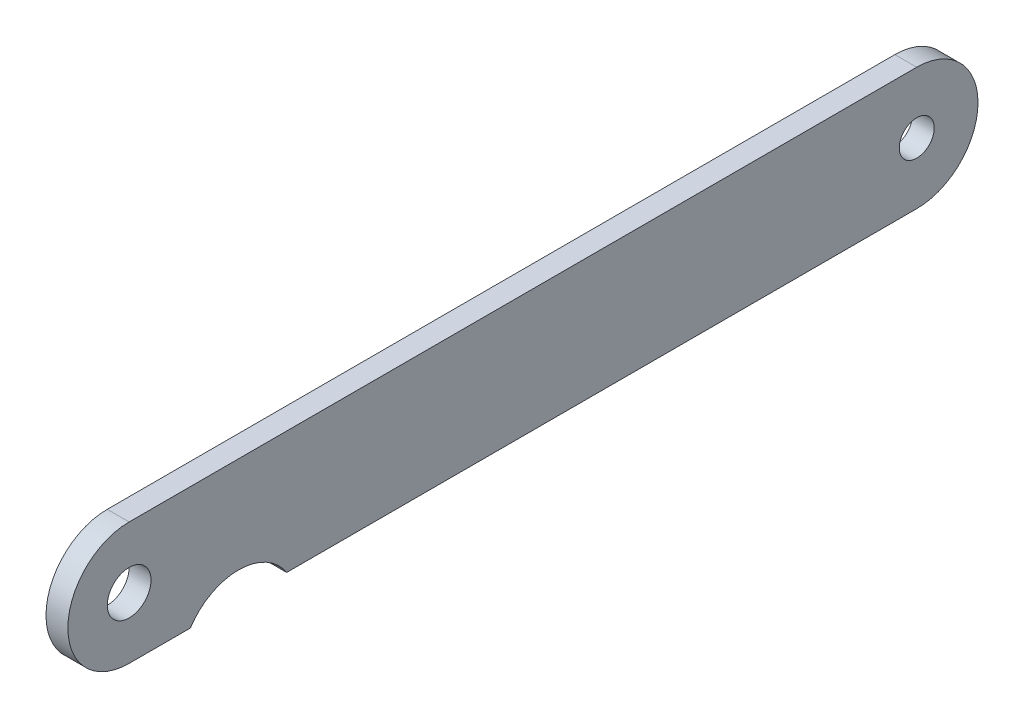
ISO-10303-21;
HEADER;
FILE_DESCRIPTION(('STEP AP214'),'2;1');
FILE_NAME('part.step','',(''),(''),'','','');
FILE_SCHEMA(('AUTOMOTIVE_DESIGN { 1 0 10303 214 1 1 1 1 }'));
ENDSEC;
DATA;
#1=APPLICATION_CONTEXT('core data for automotive mechanical design processes');
#2=APPLICATION_PROTOCOL_DEFINITION('international standard','automotive_design',2000,#1);
#3=PRODUCT_CONTEXT('',#1,'mechanical');
#4=PRODUCT('Part','Part','',(#3));
#5=PRODUCT_RELATED_PRODUCT_CATEGORY('part','',(#4));
#6=PRODUCT_DEFINITION_FORMATION('','',#4);
#7=PRODUCT_DEFINITION_CONTEXT('part definition',#1,'design');
#8=PRODUCT_DEFINITION('design','',#6,#7);
#9=PRODUCT_DEFINITION_SHAPE('','',#8);
#10=(LENGTH_UNIT() NAMED_UNIT(*) SI_UNIT(.MILLI.,.METRE.));
#11=(NAMED_UNIT(*) PLANE_ANGLE_UNIT() SI_UNIT($,.RADIAN.));
#12=(NAMED_UNIT(*) SI_UNIT($,.STERADIAN.) SOLID_ANGLE_UNIT());
#13=UNCERTAINTY_MEASURE_WITH_UNIT(LENGTH_MEASURE(1.E-05),#10,'distance_accuracy_value','');
#14=(GEOMETRIC_REPRESENTATION_CONTEXT(3) GLOBAL_UNCERTAINTY_ASSIGNED_CONTEXT((#13)) GLOBAL_UNIT_ASSIGNED_CONTEXT((#10,
#11,#12)) REPRESENTATION_CONTEXT('',''));
#15=CARTESIAN_POINT('',(0.,0.,0.));
#16=DIRECTION('',(0.,0.,1.));
#17=DIRECTION('',(1.,0.,0.));
#18=AXIS2_PLACEMENT_3D('',#15,#16,#17);
#19=CARTESIAN_POINT('',(2.49999999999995,-6.99999999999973,2.22044604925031E-13));
#20=DIRECTION('',(-0.999999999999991,0.,0.));
#21=DIRECTION('',(0.,0.,0.999999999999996));
#22=AXIS2_PLACEMENT_3D('',#19,#20,#21);
#23=PLANE('',#22);
#24=CARTESIAN_POINT('',(2.50000000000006,-7.00000000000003,-89.9999999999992));
#25=DIRECTION('',(0.999999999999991,0.,0.));
#26=DIRECTION('',(0.,0.,-0.999999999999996));
#27=AXIS2_PLACEMENT_3D('',#24,#25,#26);
#28=CIRCLE('',#27,1.99999999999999);
#29=CARTESIAN_POINT('',(2.50000000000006,-7.00000000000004,-91.9999999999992));
#30=VERTEX_POINT('',#29);
#31=EDGE_CURVE('E146',#30,#30,#28,.T.);
#32=ORIENTED_EDGE('',*,*,#31,.F.);
#33=EDGE_LOOP('',(#32));
#34=FACE_BOUND('',#33,.T.);
#35=DIRECTION('',(0.,0.,-0.999999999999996));
#36=VECTOR('',#35,1.);
#37=CARTESIAN_POINT('',(2.49999999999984,-14.0000000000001,1.33226762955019E-12));
#38=LINE('',#37,#36);
#39=CARTESIAN_POINT('',(2.49999999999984,-14.0000000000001,1.33226762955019E-12));
#40=VERTEX_POINT('',#39);
#41=CARTESIAN_POINT('',(2.49999999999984,-14.0000000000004,-6.99999999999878));
#42=VERTEX_POINT('',#41);
#43=EDGE_CURVE('E100',#40,#42,#38,.T.);
#44=ORIENTED_EDGE('',*,*,#43,.T.);
#45=CARTESIAN_POINT('',(2.49999999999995,-17.5416666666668,-12.4999999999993));
#46=DIRECTION('',(0.999999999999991,0.,0.));
#47=DIRECTION('',(0.,0.,0.999999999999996));
#48=AXIS2_PLACEMENT_3D('',#45,#46,#47);
#49=CIRCLE('',#48,6.54166666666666);
#50=CARTESIAN_POINT('',(2.49999999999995,-14.0000000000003,-17.9999999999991));
#51=VERTEX_POINT('',#50);
#52=EDGE_CURVE('E88',#51,#42,#49,.T.);
#53=ORIENTED_EDGE('',*,*,#52,.F.);
#54=CARTESIAN_POINT('',(2.49999999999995,-14.0000000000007,-89.9999999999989));
#55=VERTEX_POINT('',#54);
#56=EDGE_CURVE('E108',#51,#55,#38,.T.);
#57=ORIENTED_EDGE('',*,*,#56,.T.);
#58=CARTESIAN_POINT('',(2.50000000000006,-7.00000000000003,-89.9999999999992));
#59=DIRECTION('',(0.999999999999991,0.,0.));
#60=DIRECTION('',(0.,0.,-0.999999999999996));
#61=AXIS2_PLACEMENT_3D('',#58,#59,#60);
#62=CIRCLE('',#61,7.);
#63=CARTESIAN_POINT('',(2.5,0.,-89.9999999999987));
#64=VERTEX_POINT('',#63);
#65=EDGE_CURVE('E107',#55,#64,#62,.T.);
#66=ORIENTED_EDGE('',*,*,#65,.T.);
#67=DIRECTION('',(0.,0.,0.999999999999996));
#68=VECTOR('',#67,1.);
#69=CARTESIAN_POINT('',(2.49999999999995,1.11022302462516E-13,4.71844785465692E-13));
#70=LINE('',#69,#68);
#71=CARTESIAN_POINT('',(2.49999999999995,1.11022302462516E-13,4.71844785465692E-13));
#72=VERTEX_POINT('',#71);
#73=EDGE_CURVE('E59',#64,#72,#70,.T.);
#74=ORIENTED_EDGE('',*,*,#73,.T.);
#75=CARTESIAN_POINT('',(2.49999999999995,-6.99999999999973,2.22044604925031E-13));
#76=DIRECTION('',(0.999999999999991,0.,0.));
#77=DIRECTION('',(0.,0.,0.999999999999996));
#78=AXIS2_PLACEMENT_3D('',#75,#76,#77);
#79=CIRCLE('',#78,7.);
#80=EDGE_CURVE('E105',#72,#40,#79,.T.);
#81=ORIENTED_EDGE('',*,*,#80,.T.);
#82=EDGE_LOOP('',(#44,#53,#57,#66,#74,#81));
#83=FACE_BOUND('',#82,.T.);
#84=CARTESIAN_POINT('',(2.49999999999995,-6.99999999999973,2.22044604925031E-13));
#85=DIRECTION('',(0.999999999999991,0.,0.));
#86=DIRECTION('',(0.,0.,-0.999999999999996));
#87=AXIS2_PLACEMENT_3D('',#84,#85,#86);
#88=CIRCLE('',#87,2.49999999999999);
#89=CARTESIAN_POINT('',(2.49999999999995,-6.99999999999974,-2.49999999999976));
#90=VERTEX_POINT('',#89);
#91=EDGE_CURVE('E152',#90,#90,#88,.T.);
#92=ORIENTED_EDGE('',*,*,#91,.F.);
#93=EDGE_LOOP('',(#92));
#94=FACE_BOUND('',#93,.T.);
#95=ADVANCED_FACE('F36',(#34,#83,#94),#23,.F.);
#96=CARTESIAN_POINT('',(2.49999999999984,-14.0000000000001,1.33226762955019E-12));
#97=DIRECTION('',(0.,0.999999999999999,0.));
#98=DIRECTION('',(0.,0.,0.999999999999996));
#99=AXIS2_PLACEMENT_3D('',#96,#97,#98);
#100=PLANE('',#99);
#101=DIRECTION('',(0.,0.,-0.999999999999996));
#102=VECTOR('',#101,1.);
#103=CARTESIAN_POINT('',(-1.11022302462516E-13,-14.0000000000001,1.33226762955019E-12));
#104=LINE('',#103,#102);
#105=CARTESIAN_POINT('',(-1.11022302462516E-13,-14.0000000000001,1.33226762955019E-12));
#106=VERTEX_POINT('',#105);
#107=CARTESIAN_POINT('',(-1.11022302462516E-13,-14.0000000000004,-6.99999999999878));
#108=VERTEX_POINT('',#107);
#109=EDGE_CURVE('E101',#106,#108,#104,.T.);
#110=ORIENTED_EDGE('',*,*,#109,.T.);
#111=DIRECTION('',(0.999999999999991,0.,0.));
#112=VECTOR('',#111,1.);
#113=CARTESIAN_POINT('',(-1.11022302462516E-13,-14.0000000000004,-6.99999999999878));
#114=LINE('',#113,#112);
#115=EDGE_CURVE('E51',#108,#42,#114,.T.);
#116=ORIENTED_EDGE('',*,*,#115,.T.);
#117=ORIENTED_EDGE('',*,*,#43,.F.);
#118=DIRECTION('',(-0.999999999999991,0.,0.));
#119=VECTOR('',#118,1.);
#120=CARTESIAN_POINT('',(2.49999999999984,-14.0000000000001,1.33226762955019E-12));
#121=LINE('',#120,#119);
#122=EDGE_CURVE('E11',#40,#106,#121,.T.);
#123=ORIENTED_EDGE('',*,*,#122,.T.);
#124=EDGE_LOOP('',(#110,#116,#117,#123));
#125=FACE_BOUND('',#124,.T.);
#126=ADVANCED_FACE('F99',(#125),#100,.F.);
#127=CARTESIAN_POINT('',(2.49999999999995,-6.99999999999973,2.22044604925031E-13));
#128=DIRECTION('',(-0.999999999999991,0.,0.));
#129=DIRECTION('',(0.,0.,0.999999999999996));
#130=AXIS2_PLACEMENT_3D('',#127,#128,#129);
#131=CYLINDRICAL_SURFACE('',#130,7.);
#132=CARTESIAN_POINT('',(0.,-6.99999999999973,2.22044604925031E-13));
#133=DIRECTION('',(0.999999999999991,0.,0.));
#134=DIRECTION('',(0.,0.,0.999999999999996));
#135=AXIS2_PLACEMENT_3D('',#132,#133,#134);
#136=CIRCLE('',#135,7.);
#137=CARTESIAN_POINT('',(0.,0.,0.));
#138=VERTEX_POINT('',#137);
#139=EDGE_CURVE('E139',#138,#106,#136,.T.);
#140=ORIENTED_EDGE('',*,*,#139,.T.);
#141=ORIENTED_EDGE('',*,*,#122,.F.);
#142=ORIENTED_EDGE('',*,*,#80,.F.);
#143=DIRECTION('',(-0.999999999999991,0.,0.));
#144=VECTOR('',#143,1.);
#145=CARTESIAN_POINT('',(2.49999999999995,1.11022302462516E-13,4.71844785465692E-13));
#146=LINE('',#145,#144);
#147=EDGE_CURVE('E115',#72,#138,#146,.T.);
#148=ORIENTED_EDGE('',*,*,#147,.T.);
#149=EDGE_LOOP('',(#140,#141,#142,#148));
#150=FACE_BOUND('',#149,.T.);
#151=ADVANCED_FACE('F38',(#150),#131,.T.);
#152=ORIENTED_EDGE('',*,*,#56,.F.);
#153=DIRECTION('',(0.999999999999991,0.,0.));
#154=VECTOR('',#153,1.);
#155=CARTESIAN_POINT('',(0.,-14.0000000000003,-17.9999999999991));
#156=LINE('',#155,#154);
#157=CARTESIAN_POINT('',(0.,-14.0000000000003,-17.9999999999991));
#158=VERTEX_POINT('',#157);
#159=EDGE_CURVE('E91',#158,#51,#156,.T.);
#160=ORIENTED_EDGE('',*,*,#159,.F.);
#161=CARTESIAN_POINT('',(-1.11022302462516E-13,-14.0000000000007,-89.9999999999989));
#162=VERTEX_POINT('',#161);
#163=EDGE_CURVE('E133',#158,#162,#104,.T.);
#164=ORIENTED_EDGE('',*,*,#163,.T.);
#165=DIRECTION('',(-0.999999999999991,0.,0.));
#166=VECTOR('',#165,1.);
#167=CARTESIAN_POINT('',(2.49999999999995,-14.0000000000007,-89.9999999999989));
#168=LINE('',#167,#166);
#169=EDGE_CURVE('E44',#55,#162,#168,.T.);
#170=ORIENTED_EDGE('',*,*,#169,.F.);
#171=EDGE_LOOP('',(#152,#160,#164,#170));
#172=FACE_BOUND('',#171,.T.);
#173=ADVANCED_FACE('F164',(#172),#100,.F.);
#174=CARTESIAN_POINT('',(2.50000000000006,-7.00000000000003,-89.9999999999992));
#175=DIRECTION('',(-0.999999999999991,0.,0.));
#176=DIRECTION('',(0.,0.,0.999999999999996));
#177=AXIS2_PLACEMENT_3D('',#174,#175,#176);
#178=CYLINDRICAL_SURFACE('',#177,7.);
#179=CARTESIAN_POINT('',(0.,-7.00000000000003,-89.9999999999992));
#180=DIRECTION('',(0.999999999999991,0.,0.));
#181=DIRECTION('',(0.,0.,-0.999999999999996));
#182=AXIS2_PLACEMENT_3D('',#179,#180,#181);
#183=CIRCLE('',#182,7.);
#184=CARTESIAN_POINT('',(0.,-2.22044604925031E-13,-89.999999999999));
#185=VERTEX_POINT('',#184);
#186=EDGE_CURVE('E127',#162,#185,#183,.T.);
#187=ORIENTED_EDGE('',*,*,#186,.T.);
#188=DIRECTION('',(-0.999999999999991,0.,0.));
#189=VECTOR('',#188,1.);
#190=CARTESIAN_POINT('',(2.5,0.,-89.9999999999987));
#191=LINE('',#190,#189);
#192=EDGE_CURVE('E118',#64,#185,#191,.T.);
#193=ORIENTED_EDGE('',*,*,#192,.F.);
#194=ORIENTED_EDGE('',*,*,#65,.F.);
#195=ORIENTED_EDGE('',*,*,#169,.T.);
#196=EDGE_LOOP('',(#187,#193,#194,#195));
#197=FACE_BOUND('',#196,.T.);
#198=ADVANCED_FACE('F125',(#197),#178,.T.);
#199=CARTESIAN_POINT('',(2.49999999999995,1.11022302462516E-13,4.71844785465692E-13));
#200=DIRECTION('',(0.,-0.999999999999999,0.));
#201=DIRECTION('',(0.,0.,-0.999999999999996));
#202=AXIS2_PLACEMENT_3D('',#199,#200,#201);
#203=PLANE('',#202);
#204=DIRECTION('',(0.,0.,0.999999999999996));
#205=VECTOR('',#204,1.);
#206=CARTESIAN_POINT('',(0.,0.,0.));
#207=LINE('',#206,#205);
#208=EDGE_CURVE('E135',#185,#138,#207,.T.);
#209=ORIENTED_EDGE('',*,*,#208,.T.);
#210=ORIENTED_EDGE('',*,*,#147,.F.);
#211=ORIENTED_EDGE('',*,*,#73,.F.);
#212=ORIENTED_EDGE('',*,*,#192,.T.);
#213=EDGE_LOOP('',(#209,#210,#211,#212));
#214=FACE_BOUND('',#213,.T.);
#215=ADVANCED_FACE('F169',(#214),#203,.F.);
#216=CARTESIAN_POINT('',(0.,-6.99999999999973,2.22044604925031E-13));
#217=DIRECTION('',(-0.999999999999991,0.,0.));
#218=DIRECTION('',(0.,0.,0.999999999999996));
#219=AXIS2_PLACEMENT_3D('',#216,#217,#218);
#220=PLANE('',#219);
#221=CARTESIAN_POINT('',(0.,-6.99999999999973,2.22044604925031E-13));
#222=DIRECTION('',(-0.999999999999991,0.,0.));
#223=DIRECTION('',(0.,0.,0.999999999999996));
#224=AXIS2_PLACEMENT_3D('',#221,#222,#223);
#225=CIRCLE('',#224,2.49999999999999);
#226=CARTESIAN_POINT('',(0.,-6.99999999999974,-2.49999999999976));
#227=VERTEX_POINT('',#226);
#228=EDGE_CURVE('E149',#227,#227,#225,.T.);
#229=ORIENTED_EDGE('',*,*,#228,.F.);
#230=EDGE_LOOP('',(#229));
#231=FACE_BOUND('',#230,.T.);
#232=CARTESIAN_POINT('',(0.,-7.00000000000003,-89.9999999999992));
#233=DIRECTION('',(-0.999999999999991,0.,0.));
#234=DIRECTION('',(0.,0.,0.999999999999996));
#235=AXIS2_PLACEMENT_3D('',#232,#233,#234);
#236=CIRCLE('',#235,1.99999999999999);
#237=CARTESIAN_POINT('',(0.,-7.00000000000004,-91.9999999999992));
#238=VERTEX_POINT('',#237);
#239=EDGE_CURVE('E95',#238,#238,#236,.T.);
#240=ORIENTED_EDGE('',*,*,#239,.F.);
#241=EDGE_LOOP('',(#240));
#242=FACE_BOUND('',#241,.T.);
#243=CARTESIAN_POINT('',(0.,-17.5416666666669,-12.4999999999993));
#244=DIRECTION('',(0.999999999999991,0.,0.));
#245=DIRECTION('',(0.,0.,0.999999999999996));
#246=AXIS2_PLACEMENT_3D('',#243,#244,#245);
#247=CIRCLE('',#246,6.54166666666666);
#248=EDGE_CURVE('E94',#158,#108,#247,.T.);
#249=ORIENTED_EDGE('',*,*,#248,.T.);
#250=ORIENTED_EDGE('',*,*,#109,.F.);
#251=ORIENTED_EDGE('',*,*,#139,.F.);
#252=ORIENTED_EDGE('',*,*,#208,.F.);
#253=ORIENTED_EDGE('',*,*,#186,.F.);
#254=ORIENTED_EDGE('',*,*,#163,.F.);
#255=EDGE_LOOP('',(#249,#250,#251,#252,#253,#254));
#256=FACE_BOUND('',#255,.T.);
#257=ADVANCED_FACE('F132',(#231,#242,#256),#220,.T.);
#258=CARTESIAN_POINT('',(0.,-17.5416666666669,-12.4999999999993));
#259=DIRECTION('',(0.999999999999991,0.,0.));
#260=DIRECTION('',(0.,0.,-0.999999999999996));
#261=AXIS2_PLACEMENT_3D('',#258,#259,#260);
#262=CYLINDRICAL_SURFACE('',#261,6.54166666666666);
#263=ORIENTED_EDGE('',*,*,#52,.T.);
#264=ORIENTED_EDGE('',*,*,#115,.F.);
#265=ORIENTED_EDGE('',*,*,#248,.F.);
#266=ORIENTED_EDGE('',*,*,#159,.T.);
#267=EDGE_LOOP('',(#263,#264,#265,#266));
#268=FACE_BOUND('',#267,.T.);
#269=ADVANCED_FACE('F89',(#268),#262,.F.);
#270=CARTESIAN_POINT('',(2.50000000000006,-7.00000000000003,-89.9999999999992));
#271=DIRECTION('',(0.999999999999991,0.,0.));
#272=DIRECTION('',(0.,0.,-0.999999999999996));
#273=AXIS2_PLACEMENT_3D('',#270,#271,#272);
#274=CYLINDRICAL_SURFACE('',#273,1.99999999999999);
#275=CARTESIAN_POINT('',(2.50000000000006,-7.00000000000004,-91.9999999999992));
#276=CARTESIAN_POINT('',(2.47395833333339,-7.00000000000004,-91.9999999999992));
#277=CARTESIAN_POINT('',(2.44791666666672,-7.00000000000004,-91.9999999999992));
#278=CARTESIAN_POINT('',(2.39583333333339,-7.00000000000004,-91.9999999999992));
#279=CARTESIAN_POINT('',(2.36979166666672,-7.00000000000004,-91.9999999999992));
#280=CARTESIAN_POINT('',(2.31770833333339,-7.00000000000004,-91.9999999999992));
#281=CARTESIAN_POINT('',(2.29166666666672,-7.00000000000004,-91.9999999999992));
#282=CARTESIAN_POINT('',(2.23958333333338,-7.00000000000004,-91.9999999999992));
#283=CARTESIAN_POINT('',(2.21354166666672,-7.00000000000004,-91.9999999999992));
#284=CARTESIAN_POINT('',(2.16145833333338,-7.00000000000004,-91.9999999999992));
#285=CARTESIAN_POINT('',(2.13541666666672,-7.00000000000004,-91.9999999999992));
#286=CARTESIAN_POINT('',(2.08333333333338,-7.00000000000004,-91.9999999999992));
#287=CARTESIAN_POINT('',(2.05729166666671,-7.00000000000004,-91.9999999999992));
#288=CARTESIAN_POINT('',(2.00520833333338,-7.00000000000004,-91.9999999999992));
#289=CARTESIAN_POINT('',(1.97916666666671,-7.00000000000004,-91.9999999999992));
#290=CARTESIAN_POINT('',(1.92708333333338,-7.00000000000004,-91.9999999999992));
#291=CARTESIAN_POINT('',(1.90104166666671,-7.00000000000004,-91.9999999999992));
#292=CARTESIAN_POINT('',(1.84895833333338,-7.00000000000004,-91.9999999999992));
#293=CARTESIAN_POINT('',(1.82291666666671,-7.00000000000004,-91.9999999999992));
#294=CARTESIAN_POINT('',(1.77083333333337,-7.00000000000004,-91.9999999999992));
#295=CARTESIAN_POINT('',(1.74479166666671,-7.00000000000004,-91.9999999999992));
#296=CARTESIAN_POINT('',(1.69270833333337,-7.00000000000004,-91.9999999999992));
#297=CARTESIAN_POINT('',(1.6666666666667,-7.00000000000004,-91.9999999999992));
#298=CARTESIAN_POINT('',(1.61458333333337,-7.00000000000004,-91.9999999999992));
#299=CARTESIAN_POINT('',(1.5885416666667,-7.00000000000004,-91.9999999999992));
#300=CARTESIAN_POINT('',(1.53645833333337,-7.00000000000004,-91.9999999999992));
#301=CARTESIAN_POINT('',(1.5104166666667,-7.00000000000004,-91.9999999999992));
#302=CARTESIAN_POINT('',(1.45833333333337,-7.00000000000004,-91.9999999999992));
#303=CARTESIAN_POINT('',(1.4322916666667,-7.00000000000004,-91.9999999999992));
#304=CARTESIAN_POINT('',(1.38020833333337,-7.00000000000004,-91.9999999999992));
#305=CARTESIAN_POINT('',(1.3541666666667,-7.00000000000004,-91.9999999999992));
#306=CARTESIAN_POINT('',(1.30208333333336,-7.00000000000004,-91.9999999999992));
#307=CARTESIAN_POINT('',(1.2760416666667,-7.00000000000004,-91.9999999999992));
#308=CARTESIAN_POINT('',(1.22395833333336,-7.00000000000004,-91.9999999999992));
#309=CARTESIAN_POINT('',(1.19791666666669,-7.00000000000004,-91.9999999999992));
#310=CARTESIAN_POINT('',(1.14583333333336,-7.00000000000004,-91.9999999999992));
#311=CARTESIAN_POINT('',(1.11979166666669,-7.00000000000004,-91.9999999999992));
#312=CARTESIAN_POINT('',(1.06770833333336,-7.00000000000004,-91.9999999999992));
#313=CARTESIAN_POINT('',(1.04166666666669,-7.00000000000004,-91.9999999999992));
#314=CARTESIAN_POINT('',(0.989583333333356,-7.00000000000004,-91.9999999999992));
#315=CARTESIAN_POINT('',(0.963541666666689,-7.00000000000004,-91.9999999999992));
#316=CARTESIAN_POINT('',(0.911458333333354,-7.00000000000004,-91.9999999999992));
#317=CARTESIAN_POINT('',(0.885416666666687,-7.00000000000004,-91.9999999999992));
#318=CARTESIAN_POINT('',(0.833333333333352,-7.00000000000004,-91.9999999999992));
#319=CARTESIAN_POINT('',(0.807291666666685,-7.00000000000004,-91.9999999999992));
#320=CARTESIAN_POINT('',(0.75520833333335,-7.00000000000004,-91.9999999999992));
#321=CARTESIAN_POINT('',(0.729166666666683,-7.00000000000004,-91.9999999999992));
#322=CARTESIAN_POINT('',(0.677083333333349,-7.00000000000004,-91.9999999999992));
#323=CARTESIAN_POINT('',(0.651041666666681,-7.00000000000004,-91.9999999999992));
#324=CARTESIAN_POINT('',(0.598958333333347,-7.00000000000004,-91.9999999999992));
#325=CARTESIAN_POINT('',(0.57291666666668,-7.00000000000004,-91.9999999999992));
#326=CARTESIAN_POINT('',(0.520833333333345,-7.00000000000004,-91.9999999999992));
#327=CARTESIAN_POINT('',(0.494791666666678,-7.00000000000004,-91.9999999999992));
#328=CARTESIAN_POINT('',(0.442708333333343,-7.00000000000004,-91.9999999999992));
#329=CARTESIAN_POINT('',(0.416666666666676,-7.00000000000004,-91.9999999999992));
#330=CARTESIAN_POINT('',(0.364583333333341,-7.00000000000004,-91.9999999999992));
#331=CARTESIAN_POINT('',(0.338541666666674,-7.00000000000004,-91.9999999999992));
#332=CARTESIAN_POINT('',(0.28645833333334,-7.00000000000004,-91.9999999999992));
#333=CARTESIAN_POINT('',(0.260416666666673,-7.00000000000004,-91.9999999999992));
#334=CARTESIAN_POINT('',(0.208333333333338,-7.00000000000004,-91.9999999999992));
#335=CARTESIAN_POINT('',(0.182291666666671,-7.00000000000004,-91.9999999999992));
#336=CARTESIAN_POINT('',(0.130208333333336,-7.00000000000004,-91.9999999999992));
#337=CARTESIAN_POINT('',(0.104166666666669,-7.00000000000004,-91.9999999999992));
#338=CARTESIAN_POINT('',(0.0520833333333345,-7.00000000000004,-91.9999999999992));
#339=CARTESIAN_POINT('',(0.0260416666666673,-7.00000000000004,-91.9999999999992));
#340=CARTESIAN_POINT('',(0.,-7.00000000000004,-91.9999999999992));
#341=B_SPLINE_CURVE_WITH_KNOTS('',3,(#275,#276,#277,#278,#279,#280,#281,#282,#283,#284,#285,
#286,#287,#288,#289,#290,#291,#292,#293,#294,#295,#296,#297,#298,#299,#300,#301,#302,#303,#304,
#305,#306,#307,#308,#309,#310,#311,#312,#313,#314,#315,#316,#317,#318,#319,#320,#321,#322,#323,
#324,#325,#326,#327,#328,#329,#330,#331,#332,#333,#334,#335,#336,#337,#338,#339,#340),
.UNSPECIFIED.,.F.,.F.,(4,2,2,2,2,2,2,2,2,2,2,2,2,2,2,2,2,2,2,2,2,2,2,2,2,2,2,2,2,2,2,2,4),(0.,
0.0781250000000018,0.156250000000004,0.234375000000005,0.312500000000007,0.390625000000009,
0.468750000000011,0.546875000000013,0.625000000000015,0.703125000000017,0.781250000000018,
0.85937500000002,0.937500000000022,1.01562500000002,1.09375000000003,1.17187500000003,
1.25000000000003,1.32812500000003,1.40625000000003,1.48437500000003,1.56250000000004,
1.64062500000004,1.71875000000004,1.79687500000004,1.87500000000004,1.95312500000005,
2.03125000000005,2.10937500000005,2.18750000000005,2.26562500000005,2.34375000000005,
2.42187500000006,2.50000000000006),.UNSPECIFIED.);
#342=EDGE_CURVE('BSEAM197',#30,#238,#341,.T.);
#343=ORIENTED_EDGE('',*,*,#31,.T.);
#344=ORIENTED_EDGE('',*,*,#239,.T.);
#345=ORIENTED_EDGE('',*,*,#342,.T.);
#346=ORIENTED_EDGE('',*,*,#342,.F.);
#347=EDGE_LOOP('',(#343,#345,#344,#346));
#348=FACE_BOUND('',#347,.T.);
#349=ADVANCED_FACE('F197',(#348),#274,.F.);
#350=CARTESIAN_POINT('',(2.49999999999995,-6.99999999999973,2.22044604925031E-13));
#351=DIRECTION('',(0.999999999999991,0.,0.));
#352=DIRECTION('',(0.,0.,-0.999999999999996));
#353=AXIS2_PLACEMENT_3D('',#350,#351,#352);
#354=CYLINDRICAL_SURFACE('',#353,2.49999999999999);
#355=CARTESIAN_POINT('',(2.49999999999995,-6.99999999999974,-2.49999999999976));
#356=CARTESIAN_POINT('',(2.47395833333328,-6.99999999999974,-2.49999999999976));
#357=CARTESIAN_POINT('',(2.44791666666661,-6.99999999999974,-2.49999999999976));
#358=CARTESIAN_POINT('',(2.39583333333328,-6.99999999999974,-2.49999999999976));
#359=CARTESIAN_POINT('',(2.36979166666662,-6.99999999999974,-2.49999999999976));
#360=CARTESIAN_POINT('',(2.31770833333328,-6.99999999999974,-2.49999999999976));
#361=CARTESIAN_POINT('',(2.29166666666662,-6.99999999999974,-2.49999999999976));
#362=CARTESIAN_POINT('',(2.23958333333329,-6.99999999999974,-2.49999999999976));
#363=CARTESIAN_POINT('',(2.21354166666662,-6.99999999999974,-2.49999999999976));
#364=CARTESIAN_POINT('',(2.16145833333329,-6.99999999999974,-2.49999999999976));
#365=CARTESIAN_POINT('',(2.13541666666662,-6.99999999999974,-2.49999999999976));
#366=CARTESIAN_POINT('',(2.08333333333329,-6.99999999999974,-2.49999999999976));
#367=CARTESIAN_POINT('',(2.05729166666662,-6.99999999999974,-2.49999999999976));
#368=CARTESIAN_POINT('',(2.00520833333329,-6.99999999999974,-2.49999999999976));
#369=CARTESIAN_POINT('',(1.97916666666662,-6.99999999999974,-2.49999999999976));
#370=CARTESIAN_POINT('',(1.92708333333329,-6.99999999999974,-2.49999999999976));
#371=CARTESIAN_POINT('',(1.90104166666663,-6.99999999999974,-2.49999999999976));
#372=CARTESIAN_POINT('',(1.84895833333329,-6.99999999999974,-2.49999999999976));
#373=CARTESIAN_POINT('',(1.82291666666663,-6.99999999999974,-2.49999999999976));
#374=CARTESIAN_POINT('',(1.7708333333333,-6.99999999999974,-2.49999999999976));
#375=CARTESIAN_POINT('',(1.74479166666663,-6.99999999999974,-2.49999999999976));
#376=CARTESIAN_POINT('',(1.6927083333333,-6.99999999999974,-2.49999999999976));
#377=CARTESIAN_POINT('',(1.66666666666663,-6.99999999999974,-2.49999999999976));
#378=CARTESIAN_POINT('',(1.6145833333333,-6.99999999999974,-2.49999999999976));
#379=CARTESIAN_POINT('',(1.58854166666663,-6.99999999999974,-2.49999999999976));
#380=CARTESIAN_POINT('',(1.5364583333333,-6.99999999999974,-2.49999999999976));
#381=CARTESIAN_POINT('',(1.51041666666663,-6.99999999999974,-2.49999999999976));
#382=CARTESIAN_POINT('',(1.4583333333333,-6.99999999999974,-2.49999999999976));
#383=CARTESIAN_POINT('',(1.43229166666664,-6.99999999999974,-2.49999999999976));
#384=CARTESIAN_POINT('',(1.3802083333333,-6.99999999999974,-2.49999999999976));
#385=CARTESIAN_POINT('',(1.35416666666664,-6.99999999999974,-2.49999999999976));
#386=CARTESIAN_POINT('',(1.30208333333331,-6.99999999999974,-2.49999999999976));
#387=CARTESIAN_POINT('',(1.27604166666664,-6.99999999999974,-2.49999999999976));
#388=CARTESIAN_POINT('',(1.22395833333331,-6.99999999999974,-2.49999999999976));
#389=CARTESIAN_POINT('',(1.19791666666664,-6.99999999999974,-2.49999999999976));
#390=CARTESIAN_POINT('',(1.14583333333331,-6.99999999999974,-2.49999999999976));
#391=CARTESIAN_POINT('',(1.11979166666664,-6.99999999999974,-2.49999999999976));
#392=CARTESIAN_POINT('',(1.06770833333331,-6.99999999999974,-2.49999999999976));
#393=CARTESIAN_POINT('',(1.04166666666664,-6.99999999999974,-2.49999999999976));
#394=CARTESIAN_POINT('',(0.989583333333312,-6.99999999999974,-2.49999999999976));
#395=CARTESIAN_POINT('',(0.963541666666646,-6.99999999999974,-2.49999999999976));
#396=CARTESIAN_POINT('',(0.911458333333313,-6.99999999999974,-2.49999999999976));
#397=CARTESIAN_POINT('',(0.885416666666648,-6.99999999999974,-2.49999999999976));
#398=CARTESIAN_POINT('',(0.833333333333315,-6.99999999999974,-2.49999999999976));
#399=CARTESIAN_POINT('',(0.807291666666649,-6.99999999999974,-2.49999999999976));
#400=CARTESIAN_POINT('',(0.755208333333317,-6.99999999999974,-2.49999999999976));
#401=CARTESIAN_POINT('',(0.729166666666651,-6.99999999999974,-2.49999999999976));
#402=CARTESIAN_POINT('',(0.677083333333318,-6.99999999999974,-2.49999999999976));
#403=CARTESIAN_POINT('',(0.651041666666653,-6.99999999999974,-2.49999999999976));
#404=CARTESIAN_POINT('',(0.59895833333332,-6.99999999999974,-2.49999999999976));
#405=CARTESIAN_POINT('',(0.572916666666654,-6.99999999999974,-2.49999999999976));
#406=CARTESIAN_POINT('',(0.520833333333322,-6.99999999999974,-2.49999999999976));
#407=CARTESIAN_POINT('',(0.494791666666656,-6.99999999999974,-2.49999999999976));
#408=CARTESIAN_POINT('',(0.442708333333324,-6.99999999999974,-2.49999999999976));
#409=CARTESIAN_POINT('',(0.416666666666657,-6.99999999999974,-2.49999999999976));
#410=CARTESIAN_POINT('',(0.364583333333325,-6.99999999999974,-2.49999999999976));
#411=CARTESIAN_POINT('',(0.338541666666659,-6.99999999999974,-2.49999999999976));
#412=CARTESIAN_POINT('',(0.286458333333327,-6.99999999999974,-2.49999999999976));
#413=CARTESIAN_POINT('',(0.260416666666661,-6.99999999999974,-2.49999999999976));
#414=CARTESIAN_POINT('',(0.208333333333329,-6.99999999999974,-2.49999999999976));
#415=CARTESIAN_POINT('',(0.182291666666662,-6.99999999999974,-2.49999999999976));
#416=CARTESIAN_POINT('',(0.13020833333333,-6.99999999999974,-2.49999999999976));
#417=CARTESIAN_POINT('',(0.104166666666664,-6.99999999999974,-2.49999999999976));
#418=CARTESIAN_POINT('',(0.0520833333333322,-6.99999999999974,-2.49999999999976));
#419=CARTESIAN_POINT('',(0.0260416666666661,-6.99999999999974,-2.49999999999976));
#420=CARTESIAN_POINT('',(0.,-6.99999999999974,-2.49999999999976));
#421=B_SPLINE_CURVE_WITH_KNOTS('',3,(#355,#356,#357,#358,#359,#360,#361,#362,#363,#364,#365,
#366,#367,#368,#369,#370,#371,#372,#373,#374,#375,#376,#377,#378,#379,#380,#381,#382,#383,#384,
#385,#386,#387,#388,#389,#390,#391,#392,#393,#394,#395,#396,#397,#398,#399,#400,#401,#402,#403,
#404,#405,#406,#407,#408,#409,#410,#411,#412,#413,#414,#415,#416,#417,#418,#419,#420),
.UNSPECIFIED.,.F.,.F.,(4,2,2,2,2,2,2,2,2,2,2,2,2,2,2,2,2,2,2,2,2,2,2,2,2,2,2,2,2,2,2,2,4),(0.,
0.0781249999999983,0.156249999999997,0.234374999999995,0.312499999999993,0.390624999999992,
0.46874999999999,0.546874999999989,0.624999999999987,0.703124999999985,0.781249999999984,
0.859374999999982,0.93749999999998,1.01562499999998,1.09374999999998,1.17187499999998,
1.24999999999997,1.32812499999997,1.40624999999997,1.48437499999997,1.56249999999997,
1.64062499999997,1.71874999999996,1.79687499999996,1.87499999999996,1.95312499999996,
2.03124999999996,2.10937499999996,2.18749999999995,2.26562499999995,2.34374999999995,
2.42187499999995,2.49999999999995),.UNSPECIFIED.);
#422=EDGE_CURVE('BSEAM156',#90,#227,#421,.T.);
#423=ORIENTED_EDGE('',*,*,#91,.T.);
#424=ORIENTED_EDGE('',*,*,#228,.T.);
#425=ORIENTED_EDGE('',*,*,#422,.T.);
#426=ORIENTED_EDGE('',*,*,#422,.F.);
#427=EDGE_LOOP('',(#423,#425,#424,#426));
#428=FACE_BOUND('',#427,.T.);
#429=ADVANCED_FACE('F156',(#428),#354,.F.);
#430=CLOSED_SHELL('',(#95,#126,#151,#173,#198,#215,#257,#269,#349,#429));
#431=MANIFOLD_SOLID_BREP('B2',#430);
#432=ADVANCED_BREP_SHAPE_REPRESENTATION('',(#18,#431),#14);
#433=SHAPE_DEFINITION_REPRESENTATION(#9,#432);
ENDSEC;
END-ISO-10303-21;
